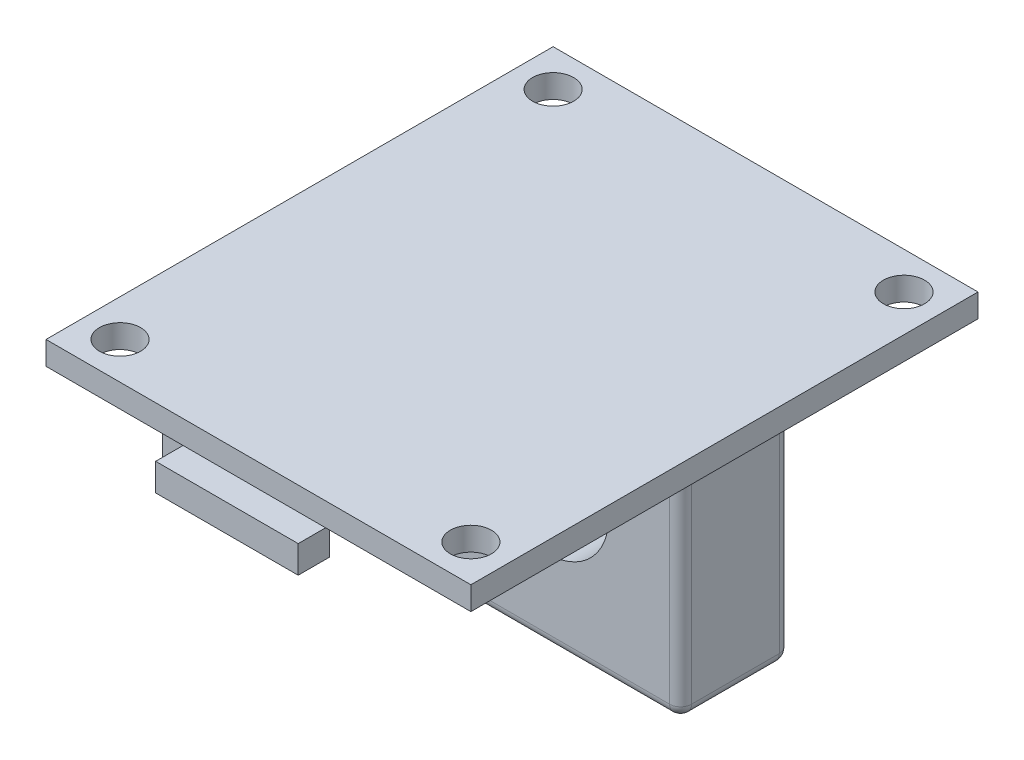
ISO-10303-21;
HEADER;
FILE_DESCRIPTION(('STEP AP214'),'2;1');
FILE_NAME('part.step','',(''),(''),'','','');
FILE_SCHEMA(('AUTOMOTIVE_DESIGN { 1 0 10303 214 1 1 1 1 }'));
ENDSEC;
DATA;
#1=APPLICATION_CONTEXT('core data for automotive mechanical design processes');
#2=APPLICATION_PROTOCOL_DEFINITION('international standard','automotive_design',2000,#1);
#3=PRODUCT_CONTEXT('',#1,'mechanical');
#4=PRODUCT('Part','Part','',(#3));
#5=PRODUCT_RELATED_PRODUCT_CATEGORY('part','',(#4));
#6=PRODUCT_DEFINITION_FORMATION('','',#4);
#7=PRODUCT_DEFINITION_CONTEXT('part definition',#1,'design');
#8=PRODUCT_DEFINITION('design','',#6,#7);
#9=PRODUCT_DEFINITION_SHAPE('','',#8);
#10=(LENGTH_UNIT() NAMED_UNIT(*) SI_UNIT(.MILLI.,.METRE.));
#11=(NAMED_UNIT(*) PLANE_ANGLE_UNIT() SI_UNIT($,.RADIAN.));
#12=(NAMED_UNIT(*) SI_UNIT($,.STERADIAN.) SOLID_ANGLE_UNIT());
#13=UNCERTAINTY_MEASURE_WITH_UNIT(LENGTH_MEASURE(1.E-05),#10,'distance_accuracy_value','');
#14=(GEOMETRIC_REPRESENTATION_CONTEXT(3) GLOBAL_UNCERTAINTY_ASSIGNED_CONTEXT((#13)) GLOBAL_UNIT_ASSIGNED_CONTEXT((#10,
#11,#12)) REPRESENTATION_CONTEXT('',''));
#15=CARTESIAN_POINT('',(0.,0.,0.));
#16=DIRECTION('',(0.,0.,1.));
#17=DIRECTION('',(1.,0.,0.));
#18=AXIS2_PLACEMENT_3D('',#15,#16,#17);
#19=CARTESIAN_POINT('',(0.,0.,0.));
#20=DIRECTION('',(0.,1.,0.));
#21=DIRECTION('',(0.,0.,1.));
#22=AXIS2_PLACEMENT_3D('',#19,#20,#21);
#23=PLANE('',#22);
#24=DIRECTION('',(0.,0.,-1.));
#25=VECTOR('',#24,1.);
#26=CARTESIAN_POINT('',(-9.29999998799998,0.,-2.09999999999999));
#27=LINE('',#26,#25);
#28=CARTESIAN_POINT('',(-9.29999998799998,0.,-2.89999999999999));
#29=VERTEX_POINT('',#28);
#30=CARTESIAN_POINT('',(-9.29999998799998,0.,-9.29999999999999));
#31=VERTEX_POINT('',#30);
#32=EDGE_CURVE('E226',#29,#31,#27,.T.);
#33=ORIENTED_EDGE('',*,*,#32,.F.);
#34=CARTESIAN_POINT('',(-8.49999998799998,0.,-2.89999999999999));
#35=DIRECTION('',(0.,1.,0.));
#36=DIRECTION('',(0.,0.,1.));
#37=AXIS2_PLACEMENT_3D('',#34,#35,#36);
#38=CIRCLE('',#37,0.8);
#39=CARTESIAN_POINT('',(-8.49999998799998,0.,-2.09999999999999));
#40=VERTEX_POINT('',#39);
#41=EDGE_CURVE('E42',#29,#40,#38,.T.);
#42=ORIENTED_EDGE('',*,*,#41,.T.);
#43=DIRECTION('',(-1.,0.,0.));
#44=VECTOR('',#43,1.);
#45=CARTESIAN_POINT('',(-9.29999998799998,0.,-2.09999999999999));
#46=LINE('',#45,#44);
#47=CARTESIAN_POINT('',(9.40000001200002,0.,-2.09999999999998));
#48=VERTEX_POINT('',#47);
#49=EDGE_CURVE('E236',#48,#40,#46,.T.);
#50=ORIENTED_EDGE('',*,*,#49,.F.);
#51=CARTESIAN_POINT('',(9.40000001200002,0.,-2.89999999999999));
#52=DIRECTION('',(0.,1.,0.));
#53=DIRECTION('',(0.,0.,1.));
#54=AXIS2_PLACEMENT_3D('',#51,#52,#53);
#55=CIRCLE('',#54,0.8);
#56=CARTESIAN_POINT('',(10.200000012,0.,-2.89999999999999));
#57=VERTEX_POINT('',#56);
#58=EDGE_CURVE('E11',#48,#57,#55,.T.);
#59=ORIENTED_EDGE('',*,*,#58,.T.);
#60=DIRECTION('',(0.,0.,1.));
#61=VECTOR('',#60,1.);
#62=CARTESIAN_POINT('',(10.200000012,0.,-2.09999999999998));
#63=LINE('',#62,#61);
#64=CARTESIAN_POINT('',(10.200000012,0.,-9.29999999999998));
#65=VERTEX_POINT('',#64);
#66=EDGE_CURVE('E233',#65,#57,#63,.T.);
#67=ORIENTED_EDGE('',*,*,#66,.F.);
#68=CARTESIAN_POINT('',(9.40000001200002,0.,-9.29999999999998));
#69=DIRECTION('',(0.,1.,0.));
#70=DIRECTION('',(0.,0.,1.));
#71=AXIS2_PLACEMENT_3D('',#68,#69,#70);
#72=CIRCLE('',#71,0.8);
#73=CARTESIAN_POINT('',(9.40000001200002,0.,-10.1));
#74=VERTEX_POINT('',#73);
#75=EDGE_CURVE('E363',#65,#74,#72,.T.);
#76=ORIENTED_EDGE('',*,*,#75,.T.);
#77=DIRECTION('',(1.,0.,0.));
#78=VECTOR('',#77,1.);
#79=CARTESIAN_POINT('',(-9.29999998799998,0.,-10.1));
#80=LINE('',#79,#78);
#81=CARTESIAN_POINT('',(-8.49999998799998,0.,-10.1));
#82=VERTEX_POINT('',#81);
#83=EDGE_CURVE('E229',#82,#74,#80,.T.);
#84=ORIENTED_EDGE('',*,*,#83,.F.);
#85=CARTESIAN_POINT('',(-8.49999998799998,0.,-9.29999999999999));
#86=DIRECTION('',(0.,1.,0.));
#87=DIRECTION('',(0.,0.,1.));
#88=AXIS2_PLACEMENT_3D('',#85,#86,#87);
#89=CIRCLE('',#88,0.8);
#90=EDGE_CURVE('E361',#82,#31,#89,.T.);
#91=ORIENTED_EDGE('',*,*,#90,.T.);
#92=EDGE_LOOP('',(#33,#42,#50,#59,#67,#76,#84,#91));
#93=FACE_BOUND('',#92,.T.);
#94=DIRECTION('',(-1.,0.,0.));
#95=VECTOR('',#94,1.);
#96=CARTESIAN_POINT('',(-14.699999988,0.,1.30000000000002));
#97=LINE('',#96,#95);
#98=CARTESIAN_POINT('',(-9.89999998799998,0.,1.30000000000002));
#99=VERTEX_POINT('',#98);
#100=CARTESIAN_POINT('',(-14.699999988,0.,1.30000000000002));
#101=VERTEX_POINT('',#100);
#102=EDGE_CURVE('E243',#99,#101,#97,.T.);
#103=ORIENTED_EDGE('',*,*,#102,.T.);
#104=DIRECTION('',(0.,0.,1.));
#105=VECTOR('',#104,1.);
#106=CARTESIAN_POINT('',(-14.699999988,0.,10.8));
#107=LINE('',#106,#105);
#108=CARTESIAN_POINT('',(-14.699999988,0.,10.8));
#109=VERTEX_POINT('',#108);
#110=EDGE_CURVE('E238',#101,#109,#107,.T.);
#111=ORIENTED_EDGE('',*,*,#110,.T.);
#112=DIRECTION('',(1.,0.,0.));
#113=VECTOR('',#112,1.);
#114=CARTESIAN_POINT('',(-14.699999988,0.,10.8));
#115=LINE('',#114,#113);
#116=CARTESIAN_POINT('',(-9.89999998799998,0.,10.8));
#117=VERTEX_POINT('',#116);
#118=EDGE_CURVE('E255',#109,#117,#115,.T.);
#119=ORIENTED_EDGE('',*,*,#118,.T.);
#120=DIRECTION('',(0.,0.,-1.));
#121=VECTOR('',#120,1.);
#122=CARTESIAN_POINT('',(-9.89999998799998,0.,10.8));
#123=LINE('',#122,#121);
#124=EDGE_CURVE('E258',#117,#99,#123,.T.);
#125=ORIENTED_EDGE('',*,*,#124,.T.);
#126=EDGE_LOOP('',(#103,#111,#119,#125));
#127=FACE_BOUND('',#126,.T.);
#128=CARTESIAN_POINT('',(-12.799999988,0.,15.8));
#129=DIRECTION('',(0.,1.,0.));
#130=DIRECTION('',(0.,0.,1.));
#131=AXIS2_PLACEMENT_3D('',#128,#129,#130);
#132=CIRCLE('',#131,1.5);
#133=CARTESIAN_POINT('',(-12.799999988,0.,17.3));
#134=VERTEX_POINT('',#133);
#135=EDGE_CURVE('E276',#134,#134,#132,.T.);
#136=ORIENTED_EDGE('',*,*,#135,.T.);
#137=EDGE_LOOP('',(#136));
#138=FACE_BOUND('',#137,.T.);
#139=CARTESIAN_POINT('',(12.799999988,0.,15.8));
#140=DIRECTION('',(0.,1.,0.));
#141=DIRECTION('',(0.,0.,1.));
#142=AXIS2_PLACEMENT_3D('',#139,#140,#141);
#143=CIRCLE('',#142,1.5);
#144=CARTESIAN_POINT('',(12.799999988,0.,17.3));
#145=VERTEX_POINT('',#144);
#146=EDGE_CURVE('E265',#145,#145,#143,.T.);
#147=ORIENTED_EDGE('',*,*,#146,.T.);
#148=EDGE_LOOP('',(#147));
#149=FACE_BOUND('',#148,.T.);
#150=CARTESIAN_POINT('',(-12.8,0.,-15.8));
#151=DIRECTION('',(0.,1.,0.));
#152=DIRECTION('',(0.,0.,1.));
#153=AXIS2_PLACEMENT_3D('',#150,#151,#152);
#154=CIRCLE('',#153,1.5);
#155=CARTESIAN_POINT('',(-12.8,0.,-14.3));
#156=VERTEX_POINT('',#155);
#157=EDGE_CURVE('E305',#156,#156,#154,.F.);
#158=ORIENTED_EDGE('',*,*,#157,.F.);
#159=EDGE_LOOP('',(#158));
#160=FACE_BOUND('',#159,.T.);
#161=CARTESIAN_POINT('',(12.8,0.,-15.8));
#162=DIRECTION('',(0.,1.,0.));
#163=DIRECTION('',(0.,0.,1.));
#164=AXIS2_PLACEMENT_3D('',#161,#162,#163);
#165=CIRCLE('',#164,1.5);
#166=CARTESIAN_POINT('',(12.8,0.,-14.3));
#167=VERTEX_POINT('',#166);
#168=EDGE_CURVE('E287',#167,#167,#165,.F.);
#169=ORIENTED_EDGE('',*,*,#168,.F.);
#170=EDGE_LOOP('',(#169));
#171=FACE_BOUND('',#170,.T.);
#172=DIRECTION('',(0.,0.,-1.));
#173=VECTOR('',#172,1.);
#174=CARTESIAN_POINT('',(-5.49999998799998,0.,20.5));
#175=LINE('',#174,#173);
#176=CARTESIAN_POINT('',(-5.49999998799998,0.,18.5));
#177=VERTEX_POINT('',#176);
#178=CARTESIAN_POINT('',(-5.49999998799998,0.,18.2));
#179=VERTEX_POINT('',#178);
#180=EDGE_CURVE('E215',#177,#179,#175,.T.);
#181=ORIENTED_EDGE('',*,*,#180,.F.);
#182=DIRECTION('',(1.,0.,0.));
#183=VECTOR('',#182,1.);
#184=CARTESIAN_POINT('',(15.499999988,0.,18.5));
#185=LINE('',#184,#183);
#186=CARTESIAN_POINT('',(-15.499999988,0.,18.5));
#187=VERTEX_POINT('',#186);
#188=EDGE_CURVE('E306',#187,#177,#185,.T.);
#189=ORIENTED_EDGE('',*,*,#188,.F.);
#190=DIRECTION('',(0.,0.,1.));
#191=VECTOR('',#190,1.);
#192=CARTESIAN_POINT('',(-15.499999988,0.,18.5));
#193=LINE('',#192,#191);
#194=CARTESIAN_POINT('',(-15.499999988,0.,-18.5));
#195=VERTEX_POINT('',#194);
#196=EDGE_CURVE('E301',#195,#187,#193,.T.);
#197=ORIENTED_EDGE('',*,*,#196,.F.);
#198=DIRECTION('',(-1.,0.,0.));
#199=VECTOR('',#198,1.);
#200=CARTESIAN_POINT('',(15.499999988,0.,-18.5));
#201=LINE('',#200,#199);
#202=CARTESIAN_POINT('',(15.499999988,0.,-18.5));
#203=VERTEX_POINT('',#202);
#204=EDGE_CURVE('E294',#203,#195,#201,.T.);
#205=ORIENTED_EDGE('',*,*,#204,.F.);
#206=DIRECTION('',(0.,0.,-1.));
#207=VECTOR('',#206,1.);
#208=CARTESIAN_POINT('',(15.499999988,0.,18.5));
#209=LINE('',#208,#207);
#210=CARTESIAN_POINT('',(15.499999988,0.,18.5));
#211=VERTEX_POINT('',#210);
#212=EDGE_CURVE('E309',#211,#203,#209,.T.);
#213=ORIENTED_EDGE('',*,*,#212,.F.);
#214=CARTESIAN_POINT('',(4.90000001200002,0.,18.5));
#215=VERTEX_POINT('',#214);
#216=EDGE_CURVE('E304',#215,#211,#185,.T.);
#217=ORIENTED_EDGE('',*,*,#216,.F.);
#218=DIRECTION('',(0.,0.,1.));
#219=VECTOR('',#218,1.);
#220=CARTESIAN_POINT('',(4.90000001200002,0.,20.5));
#221=LINE('',#220,#219);
#222=CARTESIAN_POINT('',(4.90000001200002,0.,18.2));
#223=VERTEX_POINT('',#222);
#224=EDGE_CURVE('E50',#223,#215,#221,.T.);
#225=ORIENTED_EDGE('',*,*,#224,.F.);
#226=DIRECTION('',(1.,0.,0.));
#227=VECTOR('',#226,1.);
#228=CARTESIAN_POINT('',(-5.49999998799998,0.,18.2));
#229=LINE('',#228,#227);
#230=EDGE_CURVE('E628',#179,#223,#229,.T.);
#231=ORIENTED_EDGE('',*,*,#230,.F.);
#232=EDGE_LOOP('',(#181,#189,#197,#205,#213,#217,#225,#231));
#233=FACE_BOUND('',#232,.T.);
#234=ADVANCED_FACE('F33',(#93,#127,#138,#149,#160,#171,#233),#23,.F.);
#235=CARTESIAN_POINT('',(-15.499999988,1.7,18.5));
#236=DIRECTION('',(1.,0.,0.));
#237=DIRECTION('',(0.,0.,-1.));
#238=AXIS2_PLACEMENT_3D('',#235,#236,#237);
#239=PLANE('',#238);
#240=ORIENTED_EDGE('',*,*,#196,.T.);
#241=DIRECTION('',(0.,-1.,0.));
#242=VECTOR('',#241,1.);
#243=CARTESIAN_POINT('',(-15.499999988,1.7,18.5));
#244=LINE('',#243,#242);
#245=CARTESIAN_POINT('',(-15.499999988,1.7,18.5));
#246=VERTEX_POINT('',#245);
#247=EDGE_CURVE('E321',#246,#187,#244,.T.);
#248=ORIENTED_EDGE('',*,*,#247,.F.);
#249=DIRECTION('',(0.,0.,1.));
#250=VECTOR('',#249,1.);
#251=CARTESIAN_POINT('',(-15.499999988,1.7,18.5));
#252=LINE('',#251,#250);
#253=CARTESIAN_POINT('',(-15.499999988,1.7,-18.5));
#254=VERTEX_POINT('',#253);
#255=EDGE_CURVE('E290',#254,#246,#252,.T.);
#256=ORIENTED_EDGE('',*,*,#255,.F.);
#257=DIRECTION('',(0.,-1.,0.));
#258=VECTOR('',#257,1.);
#259=CARTESIAN_POINT('',(-15.499999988,1.7,-18.5));
#260=LINE('',#259,#258);
#261=EDGE_CURVE('E300',#254,#195,#260,.T.);
#262=ORIENTED_EDGE('',*,*,#261,.T.);
#263=EDGE_LOOP('',(#240,#248,#256,#262));
#264=FACE_BOUND('',#263,.T.);
#265=ADVANCED_FACE('F477',(#264),#239,.F.);
#266=CARTESIAN_POINT('',(15.499999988,1.7,18.5));
#267=DIRECTION('',(0.,0.,-1.));
#268=DIRECTION('',(-1.,0.,0.));
#269=AXIS2_PLACEMENT_3D('',#266,#267,#268);
#270=PLANE('',#269);
#271=ORIENTED_EDGE('',*,*,#188,.T.);
#272=EDGE_CURVE('E310',#177,#215,#185,.T.);
#273=ORIENTED_EDGE('',*,*,#272,.T.);
#274=ORIENTED_EDGE('',*,*,#216,.T.);
#275=DIRECTION('',(0.,-1.,0.));
#276=VECTOR('',#275,1.);
#277=CARTESIAN_POINT('',(15.499999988,1.7,18.5));
#278=LINE('',#277,#276);
#279=CARTESIAN_POINT('',(15.499999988,1.7,18.5));
#280=VERTEX_POINT('',#279);
#281=EDGE_CURVE('E318',#280,#211,#278,.T.);
#282=ORIENTED_EDGE('',*,*,#281,.F.);
#283=DIRECTION('',(1.,0.,0.));
#284=VECTOR('',#283,1.);
#285=CARTESIAN_POINT('',(15.499999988,1.7,18.5));
#286=LINE('',#285,#284);
#287=EDGE_CURVE('E293',#246,#280,#286,.T.);
#288=ORIENTED_EDGE('',*,*,#287,.F.);
#289=ORIENTED_EDGE('',*,*,#247,.T.);
#290=EDGE_LOOP('',(#271,#273,#274,#282,#288,#289));
#291=FACE_BOUND('',#290,.T.);
#292=ADVANCED_FACE('F484',(#291),#270,.F.);
#293=CARTESIAN_POINT('',(15.499999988,1.7,18.5));
#294=DIRECTION('',(-1.,0.,0.));
#295=DIRECTION('',(0.,0.,1.));
#296=AXIS2_PLACEMENT_3D('',#293,#294,#295);
#297=PLANE('',#296);
#298=ORIENTED_EDGE('',*,*,#212,.T.);
#299=DIRECTION('',(0.,-1.,0.));
#300=VECTOR('',#299,1.);
#301=CARTESIAN_POINT('',(15.499999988,1.7,-18.5));
#302=LINE('',#301,#300);
#303=CARTESIAN_POINT('',(15.499999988,1.7,-18.5));
#304=VERTEX_POINT('',#303);
#305=EDGE_CURVE('E315',#304,#203,#302,.T.);
#306=ORIENTED_EDGE('',*,*,#305,.F.);
#307=DIRECTION('',(0.,0.,-1.));
#308=VECTOR('',#307,1.);
#309=CARTESIAN_POINT('',(15.499999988,1.7,18.5));
#310=LINE('',#309,#308);
#311=EDGE_CURVE('E296',#280,#304,#310,.T.);
#312=ORIENTED_EDGE('',*,*,#311,.F.);
#313=ORIENTED_EDGE('',*,*,#281,.T.);
#314=EDGE_LOOP('',(#298,#306,#312,#313));
#315=FACE_BOUND('',#314,.T.);
#316=ADVANCED_FACE('F494',(#315),#297,.F.);
#317=CARTESIAN_POINT('',(15.499999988,1.7,-18.5));
#318=DIRECTION('',(0.,0.,1.));
#319=DIRECTION('',(1.,0.,0.));
#320=AXIS2_PLACEMENT_3D('',#317,#318,#319);
#321=PLANE('',#320);
#322=ORIENTED_EDGE('',*,*,#204,.T.);
#323=ORIENTED_EDGE('',*,*,#261,.F.);
#324=DIRECTION('',(-1.,0.,0.));
#325=VECTOR('',#324,1.);
#326=CARTESIAN_POINT('',(15.499999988,1.7,-18.5));
#327=LINE('',#326,#325);
#328=EDGE_CURVE('E298',#304,#254,#327,.T.);
#329=ORIENTED_EDGE('',*,*,#328,.F.);
#330=ORIENTED_EDGE('',*,*,#305,.T.);
#331=EDGE_LOOP('',(#322,#323,#329,#330));
#332=FACE_BOUND('',#331,.T.);
#333=ADVANCED_FACE('F491',(#332),#321,.F.);
#334=CARTESIAN_POINT('',(0.,1.7,0.));
#335=DIRECTION('',(0.,1.,0.));
#336=DIRECTION('',(0.,0.,1.));
#337=AXIS2_PLACEMENT_3D('',#334,#335,#336);
#338=PLANE('',#337);
#339=CARTESIAN_POINT('',(-12.799999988,1.7,15.8));
#340=DIRECTION('',(0.,1.,0.));
#341=DIRECTION('',(0.,0.,1.));
#342=AXIS2_PLACEMENT_3D('',#339,#340,#341);
#343=CIRCLE('',#342,1.5);
#344=CARTESIAN_POINT('',(-12.799999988,1.7,17.3));
#345=VERTEX_POINT('',#344);
#346=EDGE_CURVE('E272',#345,#345,#343,.T.);
#347=ORIENTED_EDGE('',*,*,#346,.F.);
#348=EDGE_LOOP('',(#347));
#349=FACE_BOUND('',#348,.T.);
#350=CARTESIAN_POINT('',(12.799999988,1.7,15.8));
#351=DIRECTION('',(0.,1.,0.));
#352=DIRECTION('',(0.,0.,1.));
#353=AXIS2_PLACEMENT_3D('',#350,#351,#352);
#354=CIRCLE('',#353,1.5);
#355=CARTESIAN_POINT('',(12.799999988,1.7,17.3));
#356=VERTEX_POINT('',#355);
#357=EDGE_CURVE('E279',#356,#356,#354,.T.);
#358=ORIENTED_EDGE('',*,*,#357,.F.);
#359=EDGE_LOOP('',(#358));
#360=FACE_BOUND('',#359,.T.);
#361=CARTESIAN_POINT('',(-12.8,1.7,-15.8));
#362=DIRECTION('',(0.,1.,0.));
#363=DIRECTION('',(0.,0.,1.));
#364=AXIS2_PLACEMENT_3D('',#361,#362,#363);
#365=CIRCLE('',#364,1.5);
#366=CARTESIAN_POINT('',(-12.8,1.7,-14.3));
#367=VERTEX_POINT('',#366);
#368=EDGE_CURVE('E284',#367,#367,#365,.T.);
#369=ORIENTED_EDGE('',*,*,#368,.F.);
#370=EDGE_LOOP('',(#369));
#371=FACE_BOUND('',#370,.T.);
#372=CARTESIAN_POINT('',(12.8,1.7,-15.8));
#373=DIRECTION('',(0.,1.,0.));
#374=DIRECTION('',(0.,0.,1.));
#375=AXIS2_PLACEMENT_3D('',#372,#373,#374);
#376=CIRCLE('',#375,1.5);
#377=CARTESIAN_POINT('',(12.8,1.7,-14.3));
#378=VERTEX_POINT('',#377);
#379=EDGE_CURVE('E275',#378,#378,#376,.T.);
#380=ORIENTED_EDGE('',*,*,#379,.F.);
#381=EDGE_LOOP('',(#380));
#382=FACE_BOUND('',#381,.T.);
#383=ORIENTED_EDGE('',*,*,#255,.T.);
#384=ORIENTED_EDGE('',*,*,#287,.T.);
#385=ORIENTED_EDGE('',*,*,#311,.T.);
#386=ORIENTED_EDGE('',*,*,#328,.T.);
#387=EDGE_LOOP('',(#383,#384,#385,#386));
#388=FACE_BOUND('',#387,.T.);
#389=ADVANCED_FACE('F489',(#349,#360,#371,#382,#388),#338,.T.);
#390=CARTESIAN_POINT('',(12.8,1.7,-15.8));
#391=DIRECTION('',(0.,-1.,0.));
#392=DIRECTION('',(0.,0.,-1.));
#393=AXIS2_PLACEMENT_3D('',#390,#391,#392);
#394=CYLINDRICAL_SURFACE('',#393,1.5);
#395=ORIENTED_EDGE('',*,*,#379,.T.);
#396=EDGE_LOOP('',(#395));
#397=FACE_BOUND('',#396,.T.);
#398=ORIENTED_EDGE('',*,*,#168,.T.);
#399=EDGE_LOOP('',(#398));
#400=FACE_BOUND('',#399,.T.);
#401=ADVANCED_FACE('F649',(#397,#400),#394,.F.);
#402=CARTESIAN_POINT('',(-12.8,1.7,-15.8));
#403=DIRECTION('',(0.,-1.,0.));
#404=DIRECTION('',(0.,0.,-1.));
#405=AXIS2_PLACEMENT_3D('',#402,#403,#404);
#406=CYLINDRICAL_SURFACE('',#405,1.5);
#407=ORIENTED_EDGE('',*,*,#368,.T.);
#408=EDGE_LOOP('',(#407));
#409=FACE_BOUND('',#408,.T.);
#410=ORIENTED_EDGE('',*,*,#157,.T.);
#411=EDGE_LOOP('',(#410));
#412=FACE_BOUND('',#411,.T.);
#413=ADVANCED_FACE('F654',(#409,#412),#406,.F.);
#414=CARTESIAN_POINT('',(12.799999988,1.7,15.8));
#415=DIRECTION('',(0.,-1.,0.));
#416=DIRECTION('',(0.,0.,-1.));
#417=AXIS2_PLACEMENT_3D('',#414,#415,#416);
#418=CYLINDRICAL_SURFACE('',#417,1.5);
#419=ORIENTED_EDGE('',*,*,#357,.T.);
#420=EDGE_LOOP('',(#419));
#421=FACE_BOUND('',#420,.T.);
#422=ORIENTED_EDGE('',*,*,#146,.F.);
#423=EDGE_LOOP('',(#422));
#424=FACE_BOUND('',#423,.T.);
#425=ADVANCED_FACE('F669',(#421,#424),#418,.F.);
#426=CARTESIAN_POINT('',(-12.799999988,1.7,15.8));
#427=DIRECTION('',(0.,-1.,0.));
#428=DIRECTION('',(0.,0.,-1.));
#429=AXIS2_PLACEMENT_3D('',#426,#427,#428);
#430=CYLINDRICAL_SURFACE('',#429,1.5);
#431=ORIENTED_EDGE('',*,*,#346,.T.);
#432=EDGE_LOOP('',(#431));
#433=FACE_BOUND('',#432,.T.);
#434=ORIENTED_EDGE('',*,*,#135,.F.);
#435=EDGE_LOOP('',(#434));
#436=FACE_BOUND('',#435,.T.);
#437=ADVANCED_FACE('F676',(#433,#436),#430,.F.);
#438=CARTESIAN_POINT('',(-14.699999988,-10.,10.8));
#439=DIRECTION('',(-1.,0.,0.));
#440=DIRECTION('',(0.,0.,1.));
#441=AXIS2_PLACEMENT_3D('',#438,#439,#440);
#442=PLANE('',#441);
#443=ORIENTED_EDGE('',*,*,#110,.F.);
#444=DIRECTION('',(0.,1.,0.));
#445=VECTOR('',#444,1.);
#446=CARTESIAN_POINT('',(-14.699999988,-10.,1.30000000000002));
#447=LINE('',#446,#445);
#448=CARTESIAN_POINT('',(-14.699999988,-10.,1.30000000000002));
#449=VERTEX_POINT('',#448);
#450=EDGE_CURVE('E263',#449,#101,#447,.T.);
#451=ORIENTED_EDGE('',*,*,#450,.F.);
#452=DIRECTION('',(0.,0.,1.));
#453=VECTOR('',#452,1.);
#454=CARTESIAN_POINT('',(-14.699999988,-10.,10.8));
#455=LINE('',#454,#453);
#456=CARTESIAN_POINT('',(-14.699999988,-10.,10.8));
#457=VERTEX_POINT('',#456);
#458=EDGE_CURVE('E239',#449,#457,#455,.T.);
#459=ORIENTED_EDGE('',*,*,#458,.T.);
#460=DIRECTION('',(0.,1.,0.));
#461=VECTOR('',#460,1.);
#462=CARTESIAN_POINT('',(-14.699999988,-10.,10.8));
#463=LINE('',#462,#461);
#464=EDGE_CURVE('E252',#457,#109,#463,.T.);
#465=ORIENTED_EDGE('',*,*,#464,.T.);
#466=EDGE_LOOP('',(#443,#451,#459,#465));
#467=FACE_BOUND('',#466,.T.);
#468=ADVANCED_FACE('F682',(#467),#442,.T.);
#469=CARTESIAN_POINT('',(-14.699999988,-10.,1.30000000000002));
#470=DIRECTION('',(0.,0.,-1.));
#471=DIRECTION('',(-1.,0.,0.));
#472=AXIS2_PLACEMENT_3D('',#469,#470,#471);
#473=PLANE('',#472);
#474=ORIENTED_EDGE('',*,*,#102,.F.);
#475=DIRECTION('',(0.,1.,0.));
#476=VECTOR('',#475,1.);
#477=CARTESIAN_POINT('',(-9.89999998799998,-10.,1.30000000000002));
#478=LINE('',#477,#476);
#479=CARTESIAN_POINT('',(-9.89999998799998,-10.,1.30000000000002));
#480=VERTEX_POINT('',#479);
#481=EDGE_CURVE('E266',#480,#99,#478,.T.);
#482=ORIENTED_EDGE('',*,*,#481,.F.);
#483=DIRECTION('',(-1.,0.,0.));
#484=VECTOR('',#483,1.);
#485=CARTESIAN_POINT('',(-14.699999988,-10.,1.30000000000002));
#486=LINE('',#485,#484);
#487=EDGE_CURVE('E249',#480,#449,#486,.T.);
#488=ORIENTED_EDGE('',*,*,#487,.T.);
#489=ORIENTED_EDGE('',*,*,#450,.T.);
#490=EDGE_LOOP('',(#474,#482,#488,#489));
#491=FACE_BOUND('',#490,.T.);
#492=ADVANCED_FACE('F686',(#491),#473,.T.);
#493=CARTESIAN_POINT('',(-9.89999998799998,-10.,10.8));
#494=DIRECTION('',(1.,0.,0.));
#495=DIRECTION('',(0.,0.,-1.));
#496=AXIS2_PLACEMENT_3D('',#493,#494,#495);
#497=PLANE('',#496);
#498=ORIENTED_EDGE('',*,*,#124,.F.);
#499=DIRECTION('',(0.,1.,0.));
#500=VECTOR('',#499,1.);
#501=CARTESIAN_POINT('',(-9.89999998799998,-10.,10.8));
#502=LINE('',#501,#500);
#503=CARTESIAN_POINT('',(-9.89999998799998,-10.,10.8));
#504=VERTEX_POINT('',#503);
#505=EDGE_CURVE('E268',#504,#117,#502,.T.);
#506=ORIENTED_EDGE('',*,*,#505,.F.);
#507=DIRECTION('',(0.,0.,-1.));
#508=VECTOR('',#507,1.);
#509=CARTESIAN_POINT('',(-9.89999998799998,-10.,10.8));
#510=LINE('',#509,#508);
#511=EDGE_CURVE('E246',#504,#480,#510,.T.);
#512=ORIENTED_EDGE('',*,*,#511,.T.);
#513=ORIENTED_EDGE('',*,*,#481,.T.);
#514=EDGE_LOOP('',(#498,#506,#512,#513));
#515=FACE_BOUND('',#514,.T.);
#516=ADVANCED_FACE('F690',(#515),#497,.T.);
#517=CARTESIAN_POINT('',(-14.699999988,-10.,10.8));
#518=DIRECTION('',(0.,0.,1.));
#519=DIRECTION('',(1.,0.,0.));
#520=AXIS2_PLACEMENT_3D('',#517,#518,#519);
#521=PLANE('',#520);
#522=ORIENTED_EDGE('',*,*,#118,.F.);
#523=ORIENTED_EDGE('',*,*,#464,.F.);
#524=DIRECTION('',(1.,0.,0.));
#525=VECTOR('',#524,1.);
#526=CARTESIAN_POINT('',(-14.699999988,-10.,10.8));
#527=LINE('',#526,#525);
#528=EDGE_CURVE('E242',#457,#504,#527,.T.);
#529=ORIENTED_EDGE('',*,*,#528,.T.);
#530=ORIENTED_EDGE('',*,*,#505,.T.);
#531=EDGE_LOOP('',(#522,#523,#529,#530));
#532=FACE_BOUND('',#531,.T.);
#533=ADVANCED_FACE('F473',(#532),#521,.T.);
#534=CARTESIAN_POINT('',(0.,-10.,0.));
#535=DIRECTION('',(0.,-1.,0.));
#536=DIRECTION('',(0.,0.,-1.));
#537=AXIS2_PLACEMENT_3D('',#534,#535,#536);
#538=PLANE('',#537);
#539=ORIENTED_EDGE('',*,*,#458,.F.);
#540=ORIENTED_EDGE('',*,*,#487,.F.);
#541=ORIENTED_EDGE('',*,*,#511,.F.);
#542=ORIENTED_EDGE('',*,*,#528,.F.);
#543=EDGE_LOOP('',(#539,#540,#541,#542));
#544=FACE_BOUND('',#543,.T.);
#545=ADVANCED_FACE('F465',(#544),#538,.T.);
#546=CARTESIAN_POINT('',(-9.29999998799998,-20.,-2.09999999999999));
#547=DIRECTION('',(1.,0.,0.));
#548=DIRECTION('',(0.,0.,-1.));
#549=AXIS2_PLACEMENT_3D('',#546,#547,#548);
#550=PLANE('',#549);
#551=ORIENTED_EDGE('',*,*,#32,.T.);
#552=DIRECTION('',(0.,1.,0.));
#553=VECTOR('',#552,1.);
#554=CARTESIAN_POINT('',(-9.29999998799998,-20.,-9.29999999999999));
#555=LINE('',#554,#553);
#556=CARTESIAN_POINT('',(-9.29999998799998,-19.2,-9.29999999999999));
#557=VERTEX_POINT('',#556);
#558=EDGE_CURVE('E339',#31,#557,#555,.F.);
#559=ORIENTED_EDGE('',*,*,#558,.T.);
#560=DIRECTION('',(0.,0.,-1.));
#561=VECTOR('',#560,1.);
#562=CARTESIAN_POINT('',(-9.29999998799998,-19.2,-2.09999999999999));
#563=LINE('',#562,#561);
#564=CARTESIAN_POINT('',(-9.29999998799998,-19.2,-2.89999999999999));
#565=VERTEX_POINT('',#564);
#566=EDGE_CURVE('E337',#557,#565,#563,.F.);
#567=ORIENTED_EDGE('',*,*,#566,.T.);
#568=DIRECTION('',(0.,1.,0.));
#569=VECTOR('',#568,1.);
#570=CARTESIAN_POINT('',(-9.29999998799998,-20.,-2.89999999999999));
#571=LINE('',#570,#569);
#572=EDGE_CURVE('E335',#565,#29,#571,.T.);
#573=ORIENTED_EDGE('',*,*,#572,.T.);
#574=EDGE_LOOP('',(#551,#559,#567,#573));
#575=FACE_BOUND('',#574,.T.);
#576=ADVANCED_FACE('F463',(#575),#550,.F.);
#577=CARTESIAN_POINT('',(-9.29999998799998,-20.,-10.1));
#578=DIRECTION('',(0.,0.,1.));
#579=DIRECTION('',(1.,0.,0.));
#580=AXIS2_PLACEMENT_3D('',#577,#578,#579);
#581=PLANE('',#580);
#582=CARTESIAN_POINT('',(0.450000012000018,-9.65326587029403,-10.1));
#583=DIRECTION('',(0.,0.,1.));
#584=DIRECTION('',(1.,0.,0.));
#585=AXIS2_PLACEMENT_3D('',#582,#583,#584);
#586=CIRCLE('',#585,4.5);
#587=CARTESIAN_POINT('',(4.95000001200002,-9.65326587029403,-10.1));
#588=VERTEX_POINT('',#587);
#589=EDGE_CURVE('E218',#588,#588,#586,.T.);
#590=ORIENTED_EDGE('',*,*,#589,.T.);
#591=EDGE_LOOP('',(#590));
#592=FACE_BOUND('',#591,.T.);
#593=DIRECTION('',(1.,0.,0.));
#594=VECTOR('',#593,1.);
#595=CARTESIAN_POINT('',(-9.29999998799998,-19.2,-10.1));
#596=LINE('',#595,#594);
#597=CARTESIAN_POINT('',(9.40000001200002,-19.2,-10.1));
#598=VERTEX_POINT('',#597);
#599=CARTESIAN_POINT('',(-8.49999998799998,-19.2,-10.1));
#600=VERTEX_POINT('',#599);
#601=EDGE_CURVE('E324',#598,#600,#596,.F.);
#602=ORIENTED_EDGE('',*,*,#601,.T.);
#603=DIRECTION('',(0.,1.,0.));
#604=VECTOR('',#603,1.);
#605=CARTESIAN_POINT('',(-8.49999998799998,-20.,-10.1));
#606=LINE('',#605,#604);
#607=EDGE_CURVE('E332',#600,#82,#606,.T.);
#608=ORIENTED_EDGE('',*,*,#607,.T.);
#609=ORIENTED_EDGE('',*,*,#83,.T.);
#610=DIRECTION('',(0.,1.,0.));
#611=VECTOR('',#610,1.);
#612=CARTESIAN_POINT('',(9.40000001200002,-20.,-10.1));
#613=LINE('',#612,#611);
#614=EDGE_CURVE('E330',#74,#598,#613,.F.);
#615=ORIENTED_EDGE('',*,*,#614,.T.);
#616=EDGE_LOOP('',(#602,#608,#609,#615));
#617=FACE_BOUND('',#616,.T.);
#618=ADVANCED_FACE('F431',(#592,#617),#581,.F.);
#619=CARTESIAN_POINT('',(10.200000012,-20.,-2.09999999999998));
#620=DIRECTION('',(-1.,0.,0.));
#621=DIRECTION('',(0.,0.,1.));
#622=AXIS2_PLACEMENT_3D('',#619,#620,#621);
#623=PLANE('',#622);
#624=DIRECTION('',(0.,0.,1.));
#625=VECTOR('',#624,1.);
#626=CARTESIAN_POINT('',(10.200000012,-19.2,-10.1));
#627=LINE('',#626,#625);
#628=CARTESIAN_POINT('',(10.200000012,-19.2,-2.89999999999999));
#629=VERTEX_POINT('',#628);
#630=CARTESIAN_POINT('',(10.200000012,-19.2,-9.29999999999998));
#631=VERTEX_POINT('',#630);
#632=EDGE_CURVE('E343',#629,#631,#627,.F.);
#633=ORIENTED_EDGE('',*,*,#632,.T.);
#634=DIRECTION('',(0.,1.,0.));
#635=VECTOR('',#634,1.);
#636=CARTESIAN_POINT('',(10.200000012,-20.,-9.29999999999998));
#637=LINE('',#636,#635);
#638=EDGE_CURVE('E345',#631,#65,#637,.T.);
#639=ORIENTED_EDGE('',*,*,#638,.T.);
#640=ORIENTED_EDGE('',*,*,#66,.T.);
#641=DIRECTION('',(0.,1.,0.));
#642=VECTOR('',#641,1.);
#643=CARTESIAN_POINT('',(10.200000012,-20.,-2.89999999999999));
#644=LINE('',#643,#642);
#645=EDGE_CURVE('E341',#57,#629,#644,.F.);
#646=ORIENTED_EDGE('',*,*,#645,.T.);
#647=EDGE_LOOP('',(#633,#639,#640,#646));
#648=FACE_BOUND('',#647,.T.);
#649=ADVANCED_FACE('F441',(#648),#623,.F.);
#650=CARTESIAN_POINT('',(-9.29999998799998,-20.,-2.09999999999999));
#651=DIRECTION('',(0.,0.,-1.));
#652=DIRECTION('',(-1.,0.,0.));
#653=AXIS2_PLACEMENT_3D('',#650,#651,#652);
#654=PLANE('',#653);
#655=CARTESIAN_POINT('',(0.450000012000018,-9.65326587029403,-2.09999999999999));
#656=DIRECTION('',(0.,0.,-1.));
#657=DIRECTION('',(-1.,0.,0.));
#658=AXIS2_PLACEMENT_3D('',#655,#656,#657);
#659=CIRCLE('',#658,4.5);
#660=CARTESIAN_POINT('',(-4.04999998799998,-9.65326587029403,-2.09999999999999));
#661=VERTEX_POINT('',#660);
#662=EDGE_CURVE('E37',#661,#661,#659,.T.);
#663=ORIENTED_EDGE('',*,*,#662,.T.);
#664=EDGE_LOOP('',(#663));
#665=FACE_BOUND('',#664,.T.);
#666=ORIENTED_EDGE('',*,*,#49,.T.);
#667=DIRECTION('',(0.,1.,0.));
#668=VECTOR('',#667,1.);
#669=CARTESIAN_POINT('',(-8.49999998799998,-20.,-2.09999999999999));
#670=LINE('',#669,#668);
#671=CARTESIAN_POINT('',(-8.49999998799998,-19.2,-2.09999999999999));
#672=VERTEX_POINT('',#671);
#673=EDGE_CURVE('E58',#40,#672,#670,.F.);
#674=ORIENTED_EDGE('',*,*,#673,.T.);
#675=DIRECTION('',(-1.,0.,0.));
#676=VECTOR('',#675,1.);
#677=CARTESIAN_POINT('',(10.200000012,-19.2,-2.09999999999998));
#678=LINE('',#677,#676);
#679=CARTESIAN_POINT('',(9.40000001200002,-19.2,-2.09999999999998));
#680=VERTEX_POINT('',#679);
#681=EDGE_CURVE('E358',#672,#680,#678,.F.);
#682=ORIENTED_EDGE('',*,*,#681,.T.);
#683=DIRECTION('',(0.,1.,0.));
#684=VECTOR('',#683,1.);
#685=CARTESIAN_POINT('',(9.40000001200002,-20.,-2.09999999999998));
#686=LINE('',#685,#684);
#687=EDGE_CURVE('E356',#680,#48,#686,.T.);
#688=ORIENTED_EDGE('',*,*,#687,.T.);
#689=EDGE_LOOP('',(#666,#674,#682,#688));
#690=FACE_BOUND('',#689,.T.);
#691=ADVANCED_FACE('F447',(#665,#690),#654,.F.);
#692=CARTESIAN_POINT('',(0.,-20.,0.));
#693=DIRECTION('',(0.,-1.,0.));
#694=DIRECTION('',(0.,0.,-1.));
#695=AXIS2_PLACEMENT_3D('',#692,#693,#694);
#696=PLANE('',#695);
#697=DIRECTION('',(1.,0.,0.));
#698=VECTOR('',#697,1.);
#699=CARTESIAN_POINT('',(10.200000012,-20.,-9.29999999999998));
#700=LINE('',#699,#698);
#701=CARTESIAN_POINT('',(-8.49999998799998,-20.,-9.29999999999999));
#702=VERTEX_POINT('',#701);
#703=CARTESIAN_POINT('',(9.40000001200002,-20.,-9.29999999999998));
#704=VERTEX_POINT('',#703);
#705=EDGE_CURVE('E351',#702,#704,#700,.T.);
#706=ORIENTED_EDGE('',*,*,#705,.T.);
#707=DIRECTION('',(0.,0.,1.));
#708=VECTOR('',#707,1.);
#709=CARTESIAN_POINT('',(9.40000001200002,-20.,-2.09999999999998));
#710=LINE('',#709,#708);
#711=CARTESIAN_POINT('',(9.40000001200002,-20.,-2.89999999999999));
#712=VERTEX_POINT('',#711);
#713=EDGE_CURVE('E353',#704,#712,#710,.T.);
#714=ORIENTED_EDGE('',*,*,#713,.T.);
#715=DIRECTION('',(-1.,0.,0.));
#716=VECTOR('',#715,1.);
#717=CARTESIAN_POINT('',(-9.29999998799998,-20.,-2.89999999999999));
#718=LINE('',#717,#716);
#719=CARTESIAN_POINT('',(-8.49999998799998,-20.,-2.89999999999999));
#720=VERTEX_POINT('',#719);
#721=EDGE_CURVE('E347',#712,#720,#718,.T.);
#722=ORIENTED_EDGE('',*,*,#721,.T.);
#723=DIRECTION('',(0.,0.,-1.));
#724=VECTOR('',#723,1.);
#725=CARTESIAN_POINT('',(-8.49999998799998,-20.,-10.1));
#726=LINE('',#725,#724);
#727=EDGE_CURVE('E349',#720,#702,#726,.T.);
#728=ORIENTED_EDGE('',*,*,#727,.T.);
#729=EDGE_LOOP('',(#706,#714,#722,#728));
#730=FACE_BOUND('',#729,.T.);
#731=ADVANCED_FACE('F413',(#730),#696,.T.);
#732=CARTESIAN_POINT('',(9.40000001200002,-20.,-2.89999999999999));
#733=DIRECTION('',(0.,1.,0.));
#734=DIRECTION('',(0.,0.,1.));
#735=AXIS2_PLACEMENT_3D('',#732,#733,#734);
#736=CYLINDRICAL_SURFACE('',#735,0.8);
#737=CARTESIAN_POINT('',(9.40000001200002,-19.2,-2.89999999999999));
#738=DIRECTION('',(0.,-1.,0.));
#739=DIRECTION('',(0.,0.,-1.));
#740=AXIS2_PLACEMENT_3D('',#737,#738,#739);
#741=CIRCLE('',#740,0.8);
#742=EDGE_CURVE('E230',#629,#680,#741,.T.);
#743=ORIENTED_EDGE('',*,*,#742,.F.);
#744=ORIENTED_EDGE('',*,*,#645,.F.);
#745=ORIENTED_EDGE('',*,*,#58,.F.);
#746=ORIENTED_EDGE('',*,*,#687,.F.);
#747=EDGE_LOOP('',(#743,#744,#745,#746));
#748=FACE_BOUND('',#747,.T.);
#749=ADVANCED_FACE('F35',(#748),#736,.T.);
#750=CARTESIAN_POINT('',(9.40000001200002,-19.2,-2.89999999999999));
#751=DIRECTION('',(0.,0.,1.));
#752=DIRECTION('',(1.,0.,0.));
#753=AXIS2_PLACEMENT_3D('',#750,#751,#752);
#754=SPHERICAL_SURFACE('',#753,0.8);
#755=CARTESIAN_POINT('',(9.40000001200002,-19.2,-2.89999999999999));
#756=DIRECTION('',(0.,0.,1.));
#757=DIRECTION('',(1.,0.,0.));
#758=AXIS2_PLACEMENT_3D('',#755,#756,#757);
#759=CIRCLE('',#758,0.8);
#760=EDGE_CURVE('E392',#629,#712,#759,.F.);
#761=ORIENTED_EDGE('',*,*,#760,.F.);
#762=ORIENTED_EDGE('',*,*,#742,.T.);
#763=CARTESIAN_POINT('',(9.40000001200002,-19.2,-2.89999999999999));
#764=DIRECTION('',(1.,0.,0.));
#765=DIRECTION('',(0.,1.,0.));
#766=AXIS2_PLACEMENT_3D('',#763,#764,#765);
#767=CIRCLE('',#766,0.8);
#768=EDGE_CURVE('E395',#712,#680,#767,.F.);
#769=ORIENTED_EDGE('',*,*,#768,.F.);
#770=EDGE_LOOP('',(#761,#762,#769));
#771=FACE_BOUND('',#770,.T.);
#772=ADVANCED_FACE('F402',(#771),#754,.T.);
#773=CARTESIAN_POINT('',(-8.49999998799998,-20.,-2.89999999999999));
#774=DIRECTION('',(0.,1.,0.));
#775=DIRECTION('',(0.,0.,1.));
#776=AXIS2_PLACEMENT_3D('',#773,#774,#775);
#777=CYLINDRICAL_SURFACE('',#776,0.8);
#778=ORIENTED_EDGE('',*,*,#41,.F.);
#779=ORIENTED_EDGE('',*,*,#572,.F.);
#780=CARTESIAN_POINT('',(-8.49999998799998,-19.2,-2.89999999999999));
#781=DIRECTION('',(0.,-1.,0.));
#782=DIRECTION('',(0.,0.,-1.));
#783=AXIS2_PLACEMENT_3D('',#780,#781,#782);
#784=CIRCLE('',#783,0.8);
#785=EDGE_CURVE('E389',#672,#565,#784,.T.);
#786=ORIENTED_EDGE('',*,*,#785,.F.);
#787=ORIENTED_EDGE('',*,*,#673,.F.);
#788=EDGE_LOOP('',(#778,#779,#786,#787));
#789=FACE_BOUND('',#788,.T.);
#790=ADVANCED_FACE('F450',(#789),#777,.T.);
#791=CARTESIAN_POINT('',(0.,-19.2,-2.89999999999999));
#792=DIRECTION('',(1.,0.,0.));
#793=DIRECTION('',(0.,0.,-1.));
#794=AXIS2_PLACEMENT_3D('',#791,#792,#793);
#795=CYLINDRICAL_SURFACE('',#794,0.8);
#796=ORIENTED_EDGE('',*,*,#768,.T.);
#797=ORIENTED_EDGE('',*,*,#681,.F.);
#798=CARTESIAN_POINT('',(-8.49999998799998,-19.2,-2.89999999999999));
#799=DIRECTION('',(-1.,0.,0.));
#800=DIRECTION('',(0.,0.,1.));
#801=AXIS2_PLACEMENT_3D('',#798,#799,#800);
#802=CIRCLE('',#801,0.8);
#803=EDGE_CURVE('E386',#720,#672,#802,.T.);
#804=ORIENTED_EDGE('',*,*,#803,.F.);
#805=ORIENTED_EDGE('',*,*,#721,.F.);
#806=EDGE_LOOP('',(#796,#797,#804,#805));
#807=FACE_BOUND('',#806,.T.);
#808=ADVANCED_FACE('F408',(#807),#795,.T.);
#809=CARTESIAN_POINT('',(9.40000001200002,-19.2,0.));
#810=DIRECTION('',(0.,0.,-1.));
#811=DIRECTION('',(-1.,0.,0.));
#812=AXIS2_PLACEMENT_3D('',#809,#810,#811);
#813=CYLINDRICAL_SURFACE('',#812,0.8);
#814=ORIENTED_EDGE('',*,*,#760,.T.);
#815=ORIENTED_EDGE('',*,*,#713,.F.);
#816=CARTESIAN_POINT('',(9.40000001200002,-19.2,-9.29999999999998));
#817=DIRECTION('',(0.,0.,-1.));
#818=DIRECTION('',(-1.,0.,0.));
#819=AXIS2_PLACEMENT_3D('',#816,#817,#818);
#820=CIRCLE('',#819,0.8);
#821=EDGE_CURVE('E383',#631,#704,#820,.T.);
#822=ORIENTED_EDGE('',*,*,#821,.F.);
#823=ORIENTED_EDGE('',*,*,#632,.F.);
#824=EDGE_LOOP('',(#814,#815,#822,#823));
#825=FACE_BOUND('',#824,.T.);
#826=ADVANCED_FACE('F419',(#825),#813,.T.);
#827=CARTESIAN_POINT('',(9.40000001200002,-20.,-9.29999999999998));
#828=DIRECTION('',(0.,1.,0.));
#829=DIRECTION('',(0.,0.,1.));
#830=AXIS2_PLACEMENT_3D('',#827,#828,#829);
#831=CYLINDRICAL_SURFACE('',#830,0.8);
#832=ORIENTED_EDGE('',*,*,#75,.F.);
#833=ORIENTED_EDGE('',*,*,#638,.F.);
#834=CARTESIAN_POINT('',(9.40000001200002,-19.2,-9.29999999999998));
#835=DIRECTION('',(0.,-1.,0.));
#836=DIRECTION('',(0.,0.,-1.));
#837=AXIS2_PLACEMENT_3D('',#834,#835,#836);
#838=CIRCLE('',#837,0.8);
#839=EDGE_CURVE('E380',#598,#631,#838,.T.);
#840=ORIENTED_EDGE('',*,*,#839,.F.);
#841=ORIENTED_EDGE('',*,*,#614,.F.);
#842=EDGE_LOOP('',(#832,#833,#840,#841));
#843=FACE_BOUND('',#842,.T.);
#844=ADVANCED_FACE('F438',(#843),#831,.T.);
#845=CARTESIAN_POINT('',(-8.49999998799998,-19.2,-2.89999999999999));
#846=DIRECTION('',(0.,0.,1.));
#847=DIRECTION('',(1.,0.,0.));
#848=AXIS2_PLACEMENT_3D('',#845,#846,#847);
#849=SPHERICAL_SURFACE('',#848,0.8);
#850=ORIENTED_EDGE('',*,*,#803,.T.);
#851=ORIENTED_EDGE('',*,*,#785,.T.);
#852=CARTESIAN_POINT('',(-8.49999998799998,-19.2,-2.89999999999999));
#853=DIRECTION('',(0.,0.,1.));
#854=DIRECTION('',(1.,0.,0.));
#855=AXIS2_PLACEMENT_3D('',#852,#853,#854);
#856=CIRCLE('',#855,0.8);
#857=EDGE_CURVE('E377',#720,#565,#856,.F.);
#858=ORIENTED_EDGE('',*,*,#857,.F.);
#859=EDGE_LOOP('',(#850,#851,#858));
#860=FACE_BOUND('',#859,.T.);
#861=ADVANCED_FACE('F453',(#860),#849,.T.);
#862=CARTESIAN_POINT('',(9.40000001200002,-19.2,-9.29999999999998));
#863=DIRECTION('',(0.,0.,1.));
#864=DIRECTION('',(1.,0.,0.));
#865=AXIS2_PLACEMENT_3D('',#862,#863,#864);
#866=SPHERICAL_SURFACE('',#865,0.8);
#867=ORIENTED_EDGE('',*,*,#839,.T.);
#868=ORIENTED_EDGE('',*,*,#821,.T.);
#869=CARTESIAN_POINT('',(9.40000001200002,-19.2,-9.29999999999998));
#870=DIRECTION('',(1.,0.,0.));
#871=DIRECTION('',(0.,0.,-1.));
#872=AXIS2_PLACEMENT_3D('',#869,#870,#871);
#873=CIRCLE('',#872,0.8);
#874=EDGE_CURVE('E374',#598,#704,#873,.F.);
#875=ORIENTED_EDGE('',*,*,#874,.F.);
#876=EDGE_LOOP('',(#867,#868,#875));
#877=FACE_BOUND('',#876,.T.);
#878=ADVANCED_FACE('F422',(#877),#866,.T.);
#879=CARTESIAN_POINT('',(-8.49999998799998,-19.2,0.));
#880=DIRECTION('',(0.,0.,1.));
#881=DIRECTION('',(1.,0.,0.));
#882=AXIS2_PLACEMENT_3D('',#879,#880,#881);
#883=CYLINDRICAL_SURFACE('',#882,0.8);
#884=ORIENTED_EDGE('',*,*,#857,.T.);
#885=ORIENTED_EDGE('',*,*,#566,.F.);
#886=CARTESIAN_POINT('',(-8.49999998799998,-19.2,-9.29999999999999));
#887=DIRECTION('',(0.,0.,-1.));
#888=DIRECTION('',(-1.,0.,0.));
#889=AXIS2_PLACEMENT_3D('',#886,#887,#888);
#890=CIRCLE('',#889,0.8);
#891=EDGE_CURVE('E371',#702,#557,#890,.T.);
#892=ORIENTED_EDGE('',*,*,#891,.F.);
#893=ORIENTED_EDGE('',*,*,#727,.F.);
#894=EDGE_LOOP('',(#884,#885,#892,#893));
#895=FACE_BOUND('',#894,.T.);
#896=ADVANCED_FACE('F456',(#895),#883,.T.);
#897=CARTESIAN_POINT('',(0.,-19.2,-9.29999999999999));
#898=DIRECTION('',(-1.,0.,0.));
#899=DIRECTION('',(0.,0.,1.));
#900=AXIS2_PLACEMENT_3D('',#897,#898,#899);
#901=CYLINDRICAL_SURFACE('',#900,0.8);
#902=ORIENTED_EDGE('',*,*,#874,.T.);
#903=ORIENTED_EDGE('',*,*,#705,.F.);
#904=CARTESIAN_POINT('',(-8.49999998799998,-19.2,-9.29999999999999));
#905=DIRECTION('',(-1.,0.,0.));
#906=DIRECTION('',(0.,0.,1.));
#907=AXIS2_PLACEMENT_3D('',#904,#905,#906);
#908=CIRCLE('',#907,0.8);
#909=EDGE_CURVE('E368',#600,#702,#908,.T.);
#910=ORIENTED_EDGE('',*,*,#909,.F.);
#911=ORIENTED_EDGE('',*,*,#601,.F.);
#912=EDGE_LOOP('',(#902,#903,#910,#911));
#913=FACE_BOUND('',#912,.T.);
#914=ADVANCED_FACE('F426',(#913),#901,.T.);
#915=CARTESIAN_POINT('',(-8.49999998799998,-19.2,-9.29999999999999));
#916=DIRECTION('',(0.,0.,1.));
#917=DIRECTION('',(1.,0.,0.));
#918=AXIS2_PLACEMENT_3D('',#915,#916,#917);
#919=SPHERICAL_SURFACE('',#918,0.8);
#920=ORIENTED_EDGE('',*,*,#909,.T.);
#921=ORIENTED_EDGE('',*,*,#891,.T.);
#922=CARTESIAN_POINT('',(-8.49999998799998,-19.2,-9.29999999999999));
#923=DIRECTION('',(0.,-1.,0.));
#924=DIRECTION('',(0.,0.,-1.));
#925=AXIS2_PLACEMENT_3D('',#922,#923,#924);
#926=CIRCLE('',#925,0.8);
#927=EDGE_CURVE('E225',#600,#557,#926,.F.);
#928=ORIENTED_EDGE('',*,*,#927,.F.);
#929=EDGE_LOOP('',(#920,#921,#928));
#930=FACE_BOUND('',#929,.T.);
#931=ADVANCED_FACE('F458',(#930),#919,.T.);
#932=CARTESIAN_POINT('',(-8.49999998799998,-20.,-9.29999999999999));
#933=DIRECTION('',(0.,1.,0.));
#934=DIRECTION('',(0.,0.,1.));
#935=AXIS2_PLACEMENT_3D('',#932,#933,#934);
#936=CYLINDRICAL_SURFACE('',#935,0.8);
#937=ORIENTED_EDGE('',*,*,#927,.T.);
#938=ORIENTED_EDGE('',*,*,#558,.F.);
#939=ORIENTED_EDGE('',*,*,#90,.F.);
#940=ORIENTED_EDGE('',*,*,#607,.F.);
#941=EDGE_LOOP('',(#937,#938,#939,#940));
#942=FACE_BOUND('',#941,.T.);
#943=ADVANCED_FACE('F461',(#942),#936,.T.);
#944=CARTESIAN_POINT('',(0.450000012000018,-9.65326587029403,-20.));
#945=DIRECTION('',(0.,0.,1.));
#946=DIRECTION('',(1.,0.,0.));
#947=AXIS2_PLACEMENT_3D('',#944,#945,#946);
#948=CYLINDRICAL_SURFACE('',#947,4.5);
#949=ORIENTED_EDGE('',*,*,#662,.F.);
#950=EDGE_LOOP('',(#949));
#951=FACE_BOUND('',#950,.T.);
#952=ORIENTED_EDGE('',*,*,#589,.F.);
#953=EDGE_LOOP('',(#952));
#954=FACE_BOUND('',#953,.T.);
#955=ADVANCED_FACE('F503',(#951,#954),#948,.F.);
#956=CARTESIAN_POINT('',(0.,0.,0.));
#957=DIRECTION('',(0.,-1.,0.));
#958=DIRECTION('',(0.,0.,-1.));
#959=AXIS2_PLACEMENT_3D('',#956,#957,#958);
#960=PLANE('',#959);
#961=CARTESIAN_POINT('',(4.90000001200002,0.,20.5));
#962=VERTEX_POINT('',#961);
#963=EDGE_CURVE('E630',#215,#962,#221,.T.);
#964=ORIENTED_EDGE('',*,*,#963,.F.);
#965=ORIENTED_EDGE('',*,*,#272,.F.);
#966=CARTESIAN_POINT('',(-5.49999998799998,0.,20.5));
#967=VERTEX_POINT('',#966);
#968=EDGE_CURVE('E625',#967,#177,#175,.T.);
#969=ORIENTED_EDGE('',*,*,#968,.F.);
#970=DIRECTION('',(-1.,0.,0.));
#971=VECTOR('',#970,1.);
#972=CARTESIAN_POINT('',(-5.49999998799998,0.,20.5));
#973=LINE('',#972,#971);
#974=EDGE_CURVE('E210',#962,#967,#973,.T.);
#975=ORIENTED_EDGE('',*,*,#974,.F.);
#976=EDGE_LOOP('',(#964,#965,#969,#975));
#977=FACE_BOUND('',#976,.T.);
#978=ADVANCED_FACE('F557',(#977),#960,.F.);
#979=CARTESIAN_POINT('',(-5.49999998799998,-2.,20.5));
#980=DIRECTION('',(1.,0.,0.));
#981=DIRECTION('',(0.,0.,-1.));
#982=AXIS2_PLACEMENT_3D('',#979,#980,#981);
#983=PLANE('',#982);
#984=ORIENTED_EDGE('',*,*,#968,.T.);
#985=ORIENTED_EDGE('',*,*,#180,.T.);
#986=DIRECTION('',(0.,1.,0.));
#987=VECTOR('',#986,1.);
#988=CARTESIAN_POINT('',(-5.49999998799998,-2.,18.2));
#989=LINE('',#988,#987);
#990=CARTESIAN_POINT('',(-5.49999998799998,-2.,18.2));
#991=VERTEX_POINT('',#990);
#992=EDGE_CURVE('E195',#991,#179,#989,.T.);
#993=ORIENTED_EDGE('',*,*,#992,.F.);
#994=DIRECTION('',(0.,0.,-1.));
#995=VECTOR('',#994,1.);
#996=CARTESIAN_POINT('',(-5.49999998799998,-2.,20.5));
#997=LINE('',#996,#995);
#998=CARTESIAN_POINT('',(-5.49999998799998,-2.,20.5));
#999=VERTEX_POINT('',#998);
#1000=EDGE_CURVE('E201',#999,#991,#997,.T.);
#1001=ORIENTED_EDGE('',*,*,#1000,.F.);
#1002=DIRECTION('',(0.,1.,0.));
#1003=VECTOR('',#1002,1.);
#1004=CARTESIAN_POINT('',(-5.49999998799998,-2.,20.5));
#1005=LINE('',#1004,#1003);
#1006=EDGE_CURVE('E621',#999,#967,#1005,.T.);
#1007=ORIENTED_EDGE('',*,*,#1006,.T.);
#1008=EDGE_LOOP('',(#984,#985,#993,#1001,#1007));
#1009=FACE_BOUND('',#1008,.T.);
#1010=ADVANCED_FACE('F213',(#1009),#983,.F.);
#1011=CARTESIAN_POINT('',(-5.49999998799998,-2.,18.2));
#1012=DIRECTION('',(0.,0.,1.));
#1013=DIRECTION('',(1.,0.,0.));
#1014=AXIS2_PLACEMENT_3D('',#1011,#1012,#1013);
#1015=PLANE('',#1014);
#1016=ORIENTED_EDGE('',*,*,#230,.T.);
#1017=DIRECTION('',(0.,1.,0.));
#1018=VECTOR('',#1017,1.);
#1019=CARTESIAN_POINT('',(4.90000001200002,-2.,18.2));
#1020=LINE('',#1019,#1018);
#1021=CARTESIAN_POINT('',(4.90000001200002,-2.,18.2));
#1022=VERTEX_POINT('',#1021);
#1023=EDGE_CURVE('E197',#1022,#223,#1020,.T.);
#1024=ORIENTED_EDGE('',*,*,#1023,.F.);
#1025=DIRECTION('',(1.,0.,0.));
#1026=VECTOR('',#1025,1.);
#1027=CARTESIAN_POINT('',(-5.49999998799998,-2.,18.2));
#1028=LINE('',#1027,#1026);
#1029=EDGE_CURVE('E191',#991,#1022,#1028,.T.);
#1030=ORIENTED_EDGE('',*,*,#1029,.F.);
#1031=ORIENTED_EDGE('',*,*,#992,.T.);
#1032=EDGE_LOOP('',(#1016,#1024,#1030,#1031));
#1033=FACE_BOUND('',#1032,.T.);
#1034=ADVANCED_FACE('F193',(#1033),#1015,.F.);
#1035=CARTESIAN_POINT('',(4.90000001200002,-2.,20.5));
#1036=DIRECTION('',(-1.,0.,0.));
#1037=DIRECTION('',(0.,0.,1.));
#1038=AXIS2_PLACEMENT_3D('',#1035,#1036,#1037);
#1039=PLANE('',#1038);
#1040=ORIENTED_EDGE('',*,*,#224,.T.);
#1041=ORIENTED_EDGE('',*,*,#963,.T.);
#1042=DIRECTION('',(0.,1.,0.));
#1043=VECTOR('',#1042,1.);
#1044=CARTESIAN_POINT('',(4.90000001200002,-2.,20.5));
#1045=LINE('',#1044,#1043);
#1046=CARTESIAN_POINT('',(4.90000001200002,-2.,20.5));
#1047=VERTEX_POINT('',#1046);
#1048=EDGE_CURVE('E219',#1047,#962,#1045,.T.);
#1049=ORIENTED_EDGE('',*,*,#1048,.F.);
#1050=DIRECTION('',(0.,0.,1.));
#1051=VECTOR('',#1050,1.);
#1052=CARTESIAN_POINT('',(4.90000001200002,-2.,20.5));
#1053=LINE('',#1052,#1051);
#1054=EDGE_CURVE('E200',#1022,#1047,#1053,.T.);
#1055=ORIENTED_EDGE('',*,*,#1054,.F.);
#1056=ORIENTED_EDGE('',*,*,#1023,.T.);
#1057=EDGE_LOOP('',(#1040,#1041,#1049,#1055,#1056));
#1058=FACE_BOUND('',#1057,.T.);
#1059=ADVANCED_FACE('F584',(#1058),#1039,.F.);
#1060=CARTESIAN_POINT('',(-5.49999998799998,-2.,20.5));
#1061=DIRECTION('',(0.,0.,-1.));
#1062=DIRECTION('',(-1.,0.,0.));
#1063=AXIS2_PLACEMENT_3D('',#1060,#1061,#1062);
#1064=PLANE('',#1063);
#1065=ORIENTED_EDGE('',*,*,#974,.T.);
#1066=ORIENTED_EDGE('',*,*,#1006,.F.);
#1067=DIRECTION('',(-1.,0.,0.));
#1068=VECTOR('',#1067,1.);
#1069=CARTESIAN_POINT('',(-5.49999998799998,-2.,20.5));
#1070=LINE('',#1069,#1068);
#1071=EDGE_CURVE('E206',#1047,#999,#1070,.T.);
#1072=ORIENTED_EDGE('',*,*,#1071,.F.);
#1073=ORIENTED_EDGE('',*,*,#1048,.T.);
#1074=EDGE_LOOP('',(#1065,#1066,#1072,#1073));
#1075=FACE_BOUND('',#1074,.T.);
#1076=ADVANCED_FACE('F591',(#1075),#1064,.F.);
#1077=CARTESIAN_POINT('',(0.,-2.,0.));
#1078=DIRECTION('',(0.,-1.,0.));
#1079=DIRECTION('',(0.,0.,-1.));
#1080=AXIS2_PLACEMENT_3D('',#1077,#1078,#1079);
#1081=PLANE('',#1080);
#1082=ORIENTED_EDGE('',*,*,#1000,.T.);
#1083=ORIENTED_EDGE('',*,*,#1029,.T.);
#1084=ORIENTED_EDGE('',*,*,#1054,.T.);
#1085=ORIENTED_EDGE('',*,*,#1071,.T.);
#1086=EDGE_LOOP('',(#1082,#1083,#1084,#1085));
#1087=FACE_BOUND('',#1086,.T.);
#1088=ADVANCED_FACE('F204',(#1087),#1081,.T.);
#1089=CLOSED_SHELL('',(#234,#265,#292,#316,#333,#389,#401,#413,#425,#437,#468,#492,#516,#533,
#545,#576,#618,#649,#691,#731,#749,#772,#790,#808,#826,#844,#861,#878,#896,#914,#931,#943,#955,
#978,#1010,#1034,#1059,#1076,#1088));
#1090=MANIFOLD_SOLID_BREP('B2',#1089);
#1091=ADVANCED_BREP_SHAPE_REPRESENTATION('',(#18,#1090),#14);
#1092=SHAPE_DEFINITION_REPRESENTATION(#9,#1091);
ENDSEC;
END-ISO-10303-21;
